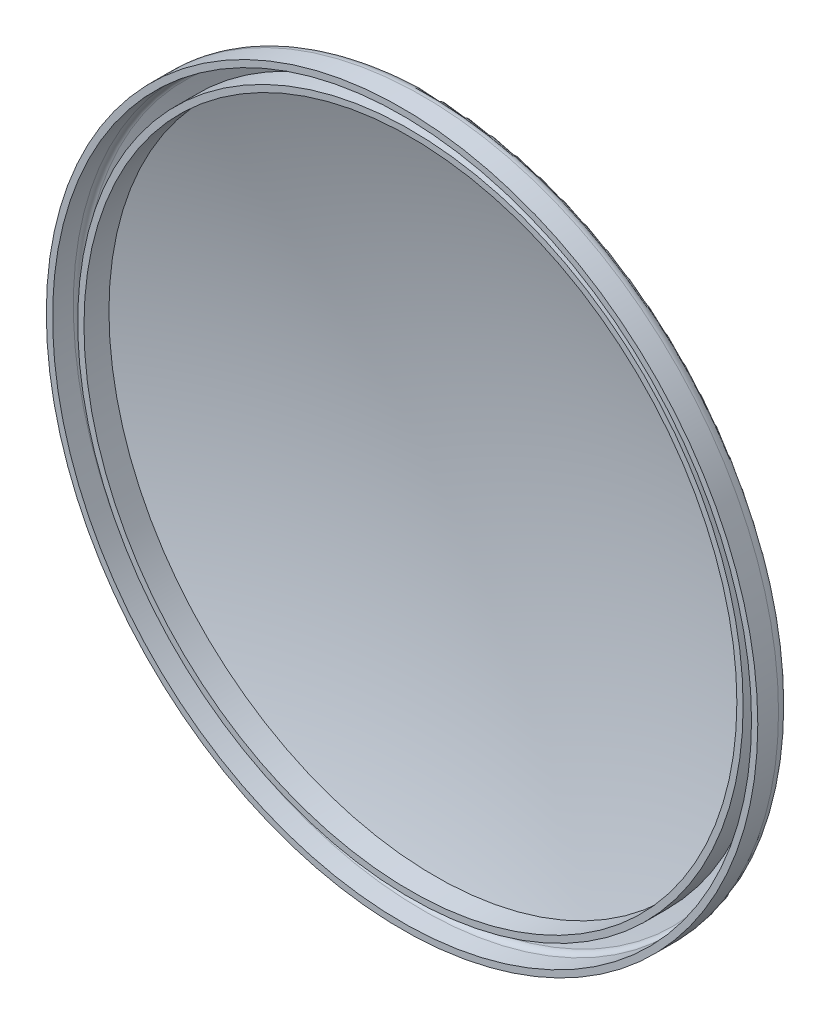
ISO-10303-21;
HEADER;
FILE_DESCRIPTION(('STEP AP214'),'2;1');
FILE_NAME('part.step','',(''),(''),'','','');
FILE_SCHEMA(('AUTOMOTIVE_DESIGN { 1 0 10303 214 1 1 1 1 }'));
ENDSEC;
DATA;
#1=APPLICATION_CONTEXT('core data for automotive mechanical design processes');
#2=APPLICATION_PROTOCOL_DEFINITION('international standard','automotive_design',2000,#1);
#3=PRODUCT_CONTEXT('',#1,'mechanical');
#4=PRODUCT('Part','Part','',(#3));
#5=PRODUCT_RELATED_PRODUCT_CATEGORY('part','',(#4));
#6=PRODUCT_DEFINITION_FORMATION('','',#4);
#7=PRODUCT_DEFINITION_CONTEXT('part definition',#1,'design');
#8=PRODUCT_DEFINITION('design','',#6,#7);
#9=PRODUCT_DEFINITION_SHAPE('','',#8);
#10=(LENGTH_UNIT() NAMED_UNIT(*) SI_UNIT(.MILLI.,.METRE.));
#11=(NAMED_UNIT(*) PLANE_ANGLE_UNIT() SI_UNIT($,.RADIAN.));
#12=(NAMED_UNIT(*) SI_UNIT($,.STERADIAN.) SOLID_ANGLE_UNIT());
#13=UNCERTAINTY_MEASURE_WITH_UNIT(LENGTH_MEASURE(1.E-05),#10,'distance_accuracy_value','');
#14=(GEOMETRIC_REPRESENTATION_CONTEXT(3) GLOBAL_UNCERTAINTY_ASSIGNED_CONTEXT((#13)) GLOBAL_UNIT_ASSIGNED_CONTEXT((#10,
#11,#12)) REPRESENTATION_CONTEXT('',''));
#15=CARTESIAN_POINT('',(0.,0.,0.));
#16=DIRECTION('',(0.,0.,1.));
#17=DIRECTION('',(1.,0.,0.));
#18=AXIS2_PLACEMENT_3D('',#15,#16,#17);
#19=CARTESIAN_POINT('',(265.1125,0.,0.));
#20=DIRECTION('',(0.,0.,1.));
#21=DIRECTION('',(1.,0.,0.));
#22=AXIS2_PLACEMENT_3D('',#19,#20,#21);
#23=PLANE('',#22);
#24=CARTESIAN_POINT('',(0.,0.,0.));
#25=DIRECTION('',(0.,0.,1.));
#26=DIRECTION('',(1.,0.,0.));
#27=AXIS2_PLACEMENT_3D('',#24,#25,#26);
#28=CIRCLE('',#27,269.875);
#29=CARTESIAN_POINT('',(269.875,0.,0.));
#30=VERTEX_POINT('',#29);
#31=EDGE_CURVE('E11',#30,#30,#28,.T.);
#32=ORIENTED_EDGE('',*,*,#31,.T.);
#33=EDGE_LOOP('',(#32));
#34=FACE_BOUND('',#33,.T.);
#35=CARTESIAN_POINT('',(0.,0.,0.));
#36=DIRECTION('',(0.,0.,1.));
#37=DIRECTION('',(1.,0.,0.));
#38=AXIS2_PLACEMENT_3D('',#35,#36,#37);
#39=CIRCLE('',#38,265.1125);
#40=CARTESIAN_POINT('',(265.1125,0.,0.));
#41=VERTEX_POINT('',#40);
#42=EDGE_CURVE('E78',#41,#41,#39,.T.);
#43=ORIENTED_EDGE('',*,*,#42,.F.);
#44=EDGE_LOOP('',(#43));
#45=FACE_BOUND('',#44,.T.);
#46=ADVANCED_FACE('F34',(#34,#45),#23,.T.);
#47=CARTESIAN_POINT('',(0.,0.,0.));
#48=DIRECTION('',(0.,0.,1.));
#49=DIRECTION('',(1.,0.,0.));
#50=AXIS2_PLACEMENT_3D('',#47,#48,#49);
#51=CYLINDRICAL_SURFACE('',#50,269.875);
#52=CARTESIAN_POINT('',(0.,0.,-15.7300507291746));
#53=DIRECTION('',(0.,0.,1.));
#54=DIRECTION('',(1.,0.,0.));
#55=AXIS2_PLACEMENT_3D('',#52,#53,#54);
#56=CIRCLE('',#55,269.875);
#57=CARTESIAN_POINT('',(269.875,0.,-15.7300507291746));
#58=VERTEX_POINT('',#57);
#59=EDGE_CURVE('E41',#58,#58,#56,.T.);
#60=ORIENTED_EDGE('',*,*,#59,.T.);
#61=EDGE_LOOP('',(#60));
#62=FACE_BOUND('',#61,.T.);
#63=ORIENTED_EDGE('',*,*,#31,.F.);
#64=EDGE_LOOP('',(#63));
#65=FACE_BOUND('',#64,.T.);
#66=ADVANCED_FACE('F86',(#62,#65),#51,.T.);
#67=CARTESIAN_POINT('',(0.,0.,-15.7300507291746));
#68=DIRECTION('',(0.,0.,1.));
#69=DIRECTION('',(1.,0.,0.));
#70=AXIS2_PLACEMENT_3D('',#67,#68,#69);
#71=TOROIDAL_SURFACE('',#70,260.35,9.52500000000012);
#72=CARTESIAN_POINT('',(0.,0.,-24.6741393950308));
#73=DIRECTION('',(0.,0.,1.));
#74=DIRECTION('',(1.,0.,0.));
#75=AXIS2_PLACEMENT_3D('',#72,#73,#74);
#76=CIRCLE('',#75,263.625500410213);
#77=CARTESIAN_POINT('',(263.625500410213,0.,-24.6741393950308));
#78=VERTEX_POINT('',#77);
#79=EDGE_CURVE('E55',#78,#78,#76,.T.);
#80=ORIENTED_EDGE('',*,*,#79,.T.);
#81=EDGE_LOOP('',(#80));
#82=FACE_BOUND('',#81,.T.);
#83=ORIENTED_EDGE('',*,*,#59,.F.);
#84=EDGE_LOOP('',(#83));
#85=FACE_BOUND('',#84,.T.);
#86=ADVANCED_FACE('F51',(#82,#85),#71,.T.);
#87=CARTESIAN_POINT('',(-0.0522826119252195,0.,695.324998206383));
#88=DIRECTION('',(0.,-1.,0.));
#89=DIRECTION('',(1.,0.,0.));
#90=AXIS2_PLACEMENT_3D('',#87,#88,#89);
#91=CIRCLE('',#90,766.7625);
#92=TRIMMED_CURVE('',#91,(PARAMETER_VALUE(-1.57072814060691)),
(PARAMETER_VALUE(1.57072814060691)),.T.,.PARAMETER.);
#93=CARTESIAN_POINT('',(0.,0.,695.324998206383));
#94=DIRECTION('',(0.,0.,1.));
#95=AXIS1_PLACEMENT('',#93,#94);
#96=SURFACE_OF_REVOLUTION('',#92,#95);
#97=CARTESIAN_POINT('',(0.,0.,-71.4375000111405));
#98=VERTEX_POINT('',#97);
#99=VERTEX_LOOP('',#98);
#100=FACE_BOUND('',#99,.T.);
#101=ORIENTED_EDGE('',*,*,#79,.F.);
#102=EDGE_LOOP('',(#101));
#103=FACE_BOUND('',#102,.T.);
#104=ADVANCED_FACE('F47',(#100,#103),#96,.T.);
#105=CARTESIAN_POINT('',(-0.0522826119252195,0.,695.324998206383));
#106=DIRECTION('',(0.,-1.,0.));
#107=DIRECTION('',(1.,0.,0.));
#108=AXIS2_PLACEMENT_3D('',#105,#106,#107);
#109=CIRCLE('',#108,762.);
#110=TRIMMED_CURVE('',#109,(PARAMETER_VALUE(-1.57072771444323)),
(PARAMETER_VALUE(1.57072771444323)),.T.,.PARAMETER.);
#111=CARTESIAN_POINT('',(0.,0.,695.324998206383));
#112=DIRECTION('',(0.,0.,1.));
#113=AXIS1_PLACEMENT('',#111,#112);
#114=SURFACE_OF_REVOLUTION('',#110,#113);
#115=CARTESIAN_POINT('',(0.,0.,-25.2911126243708));
#116=DIRECTION('',(0.,0.,1.));
#117=DIRECTION('',(1.,0.,0.));
#118=AXIS2_PLACEMENT_3D('',#115,#116,#117);
#119=CIRCLE('',#118,247.65);
#120=CARTESIAN_POINT('',(247.65,0.,-25.2911126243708));
#121=VERTEX_POINT('',#120);
#122=EDGE_CURVE('E57',#121,#121,#119,.T.);
#123=ORIENTED_EDGE('',*,*,#122,.T.);
#124=EDGE_LOOP('',(#123));
#125=FACE_BOUND('',#124,.T.);
#126=CARTESIAN_POINT('',(0.,0.,-66.675));
#127=VERTEX_POINT('',#126);
#128=VERTEX_LOOP('',#127);
#129=FACE_BOUND('',#128,.T.);
#130=ADVANCED_FACE('F50',(#125,#129),#114,.F.);
#131=CARTESIAN_POINT('',(0.,0.,0.));
#132=DIRECTION('',(0.,0.,1.));
#133=DIRECTION('',(1.,0.,0.));
#134=AXIS2_PLACEMENT_3D('',#131,#132,#133);
#135=CYLINDRICAL_SURFACE('',#134,247.65);
#136=CARTESIAN_POINT('',(0.,0.,-6.35));
#137=DIRECTION('',(0.,0.,1.));
#138=DIRECTION('',(1.,0.,0.));
#139=AXIS2_PLACEMENT_3D('',#136,#137,#138);
#140=CIRCLE('',#139,247.65);
#141=CARTESIAN_POINT('',(247.65,0.,-6.35));
#142=VERTEX_POINT('',#141);
#143=EDGE_CURVE('E61',#142,#142,#140,.T.);
#144=ORIENTED_EDGE('',*,*,#143,.T.);
#145=EDGE_LOOP('',(#144));
#146=FACE_BOUND('',#145,.T.);
#147=ORIENTED_EDGE('',*,*,#122,.F.);
#148=EDGE_LOOP('',(#147));
#149=FACE_BOUND('',#148,.T.);
#150=ADVANCED_FACE('F101',(#146,#149),#135,.F.);
#151=CARTESIAN_POINT('',(247.65,0.,-6.35));
#152=DIRECTION('',(0.,0.,1.));
#153=DIRECTION('',(1.,0.,0.));
#154=AXIS2_PLACEMENT_3D('',#151,#152,#153);
#155=PLANE('',#154);
#156=CARTESIAN_POINT('',(0.,0.,-6.35));
#157=DIRECTION('',(0.,0.,1.));
#158=DIRECTION('',(1.,0.,0.));
#159=AXIS2_PLACEMENT_3D('',#156,#157,#158);
#160=CIRCLE('',#159,252.4125);
#161=CARTESIAN_POINT('',(252.4125,0.,-6.35));
#162=VERTEX_POINT('',#161);
#163=EDGE_CURVE('E66',#162,#162,#160,.T.);
#164=ORIENTED_EDGE('',*,*,#163,.T.);
#165=EDGE_LOOP('',(#164));
#166=FACE_BOUND('',#165,.T.);
#167=ORIENTED_EDGE('',*,*,#143,.F.);
#168=EDGE_LOOP('',(#167));
#169=FACE_BOUND('',#168,.T.);
#170=ADVANCED_FACE('F105',(#166,#169),#155,.T.);
#171=CARTESIAN_POINT('',(0.,0.,0.));
#172=DIRECTION('',(0.,0.,1.));
#173=DIRECTION('',(1.,0.,0.));
#174=AXIS2_PLACEMENT_3D('',#171,#172,#173);
#175=CYLINDRICAL_SURFACE('',#174,252.4125);
#176=CARTESIAN_POINT('',(0.,0.,-23.6364288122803));
#177=DIRECTION('',(0.,0.,1.));
#178=DIRECTION('',(1.,0.,0.));
#179=AXIS2_PLACEMENT_3D('',#176,#177,#178);
#180=CIRCLE('',#179,252.4125);
#181=CARTESIAN_POINT('',(252.4125,0.,-23.6364288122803));
#182=VERTEX_POINT('',#181);
#183=EDGE_CURVE('E69',#182,#182,#180,.T.);
#184=ORIENTED_EDGE('',*,*,#183,.T.);
#185=EDGE_LOOP('',(#184));
#186=FACE_BOUND('',#185,.T.);
#187=ORIENTED_EDGE('',*,*,#163,.F.);
#188=EDGE_LOOP('',(#187));
#189=FACE_BOUND('',#188,.T.);
#190=ADVANCED_FACE('F109',(#186,#189),#175,.T.);
#191=CARTESIAN_POINT('',(0.,0.,695.324998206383));
#192=DIRECTION('',(0.,0.,1.));
#193=DIRECTION('',(1.,0.,0.));
#194=AXIS2_PLACEMENT_3D('',#191,#192,#193);
#195=DEGENERATE_TOROIDAL_SURFACE('',#194,0.0522826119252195,762.,.F.);
#196=CARTESIAN_POINT('',(0.,0.,-20.2020950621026));
#197=DIRECTION('',(0.,0.,1.));
#198=DIRECTION('',(1.,0.,0.));
#199=AXIS2_PLACEMENT_3D('',#196,#197,#198);
#200=CIRCLE('',#199,261.987750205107);
#201=CARTESIAN_POINT('',(261.987750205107,0.,-20.2020950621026));
#202=VERTEX_POINT('',#201);
#203=EDGE_CURVE('E72',#202,#202,#200,.T.);
#204=ORIENTED_EDGE('',*,*,#203,.T.);
#205=EDGE_LOOP('',(#204));
#206=FACE_BOUND('',#205,.T.);
#207=ORIENTED_EDGE('',*,*,#183,.F.);
#208=EDGE_LOOP('',(#207));
#209=FACE_BOUND('',#208,.T.);
#210=ADVANCED_FACE('F113',(#206,#209),#195,.T.);
#211=CARTESIAN_POINT('',(0.,0.,-15.7300507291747));
#212=DIRECTION('',(0.,0.,1.));
#213=DIRECTION('',(1.,0.,0.));
#214=AXIS2_PLACEMENT_3D('',#211,#212,#213);
#215=TOROIDAL_SURFACE('',#214,260.35,4.76250000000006);
#216=CARTESIAN_POINT('',(0.,0.,-15.7300507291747));
#217=DIRECTION('',(0.,0.,1.));
#218=DIRECTION('',(1.,0.,0.));
#219=AXIS2_PLACEMENT_3D('',#216,#217,#218);
#220=CIRCLE('',#219,265.1125);
#221=CARTESIAN_POINT('',(265.1125,0.,-15.7300507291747));
#222=VERTEX_POINT('',#221);
#223=EDGE_CURVE('E75',#222,#222,#220,.T.);
#224=ORIENTED_EDGE('',*,*,#223,.T.);
#225=EDGE_LOOP('',(#224));
#226=FACE_BOUND('',#225,.T.);
#227=ORIENTED_EDGE('',*,*,#203,.F.);
#228=EDGE_LOOP('',(#227));
#229=FACE_BOUND('',#228,.T.);
#230=ADVANCED_FACE('F117',(#226,#229),#215,.F.);
#231=CARTESIAN_POINT('',(0.,0.,0.));
#232=DIRECTION('',(0.,0.,1.));
#233=DIRECTION('',(1.,0.,0.));
#234=AXIS2_PLACEMENT_3D('',#231,#232,#233);
#235=CYLINDRICAL_SURFACE('',#234,265.1125);
#236=ORIENTED_EDGE('',*,*,#42,.T.);
#237=EDGE_LOOP('',(#236));
#238=FACE_BOUND('',#237,.T.);
#239=ORIENTED_EDGE('',*,*,#223,.F.);
#240=EDGE_LOOP('',(#239));
#241=FACE_BOUND('',#240,.T.);
#242=ADVANCED_FACE('F82',(#238,#241),#235,.F.);
#243=CLOSED_SHELL('',(#46,#66,#86,#104,#130,#150,#170,#190,#210,#230,#242));
#244=MANIFOLD_SOLID_BREP('B2',#243);
#245=ADVANCED_BREP_SHAPE_REPRESENTATION('',(#18,#244),#14);
#246=SHAPE_DEFINITION_REPRESENTATION(#9,#245);
ENDSEC;
END-ISO-10303-21;
